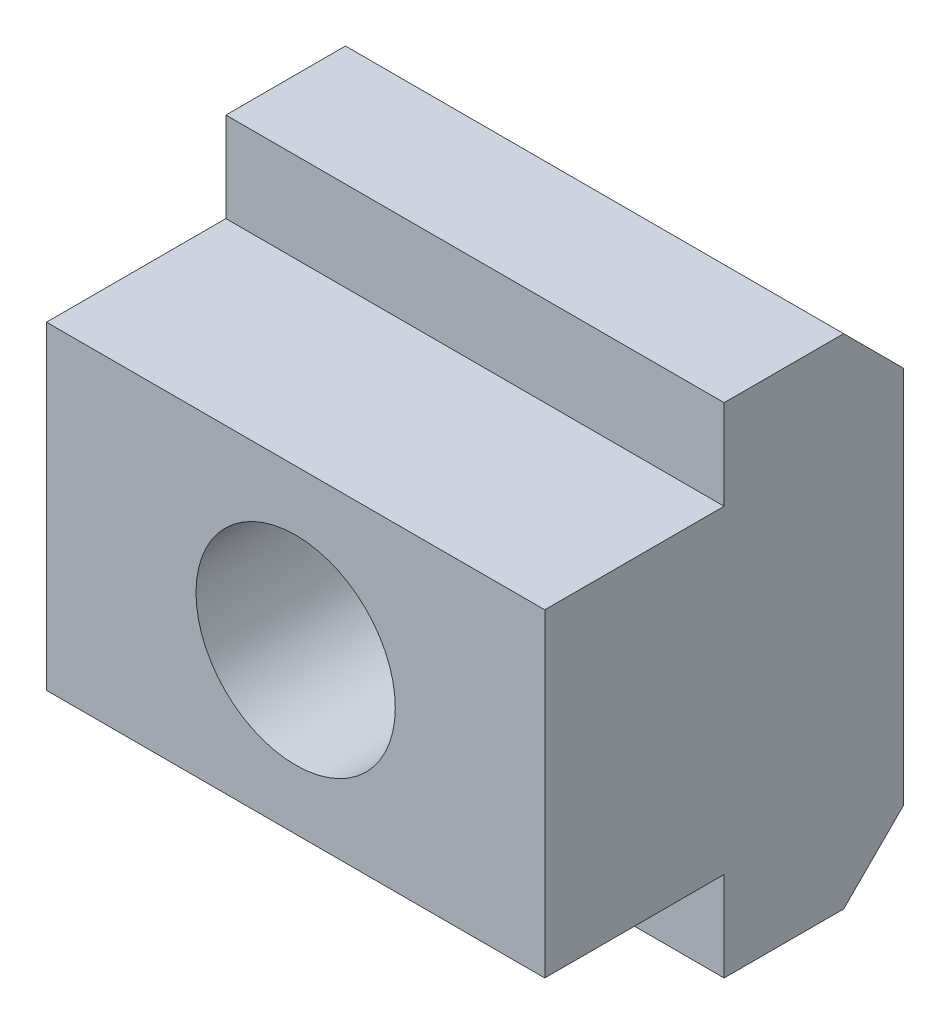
ISO-10303-21;
HEADER;
FILE_DESCRIPTION(('STEP AP214'),'2;1');
FILE_NAME('part.step','',(''),(''),'','','');
FILE_SCHEMA(('AUTOMOTIVE_DESIGN { 1 0 10303 214 1 1 1 1 }'));
ENDSEC;
DATA;
#1=APPLICATION_CONTEXT('core data for automotive mechanical design processes');
#2=APPLICATION_PROTOCOL_DEFINITION('international standard','automotive_design',2000,#1);
#3=PRODUCT_CONTEXT('',#1,'mechanical');
#4=PRODUCT('Part','Part','',(#3));
#5=PRODUCT_RELATED_PRODUCT_CATEGORY('part','',(#4));
#6=PRODUCT_DEFINITION_FORMATION('','',#4);
#7=PRODUCT_DEFINITION_CONTEXT('part definition',#1,'design');
#8=PRODUCT_DEFINITION('design','',#6,#7);
#9=PRODUCT_DEFINITION_SHAPE('','',#8);
#10=(LENGTH_UNIT() NAMED_UNIT(*) SI_UNIT(.MILLI.,.METRE.));
#11=(NAMED_UNIT(*) PLANE_ANGLE_UNIT() SI_UNIT($,.RADIAN.));
#12=(NAMED_UNIT(*) SI_UNIT($,.STERADIAN.) SOLID_ANGLE_UNIT());
#13=UNCERTAINTY_MEASURE_WITH_UNIT(LENGTH_MEASURE(1.E-05),#10,'distance_accuracy_value','');
#14=(GEOMETRIC_REPRESENTATION_CONTEXT(3) GLOBAL_UNCERTAINTY_ASSIGNED_CONTEXT((#13)) GLOBAL_UNIT_ASSIGNED_CONTEXT((#10,
#11,#12)) REPRESENTATION_CONTEXT('',''));
#15=CARTESIAN_POINT('',(0.,0.,0.));
#16=DIRECTION('',(0.,0.,1.));
#17=DIRECTION('',(1.,0.,0.));
#18=AXIS2_PLACEMENT_3D('',#15,#16,#17);
#19=CARTESIAN_POINT('',(-12.5,-8.,9.));
#20=DIRECTION('',(0.,1.,0.));
#21=DIRECTION('',(0.,0.,-1.));
#22=AXIS2_PLACEMENT_3D('',#19,#20,#21);
#23=PLANE('',#22);
#24=DIRECTION('',(0.,0.,1.));
#25=VECTOR('',#24,1.);
#26=CARTESIAN_POINT('',(12.5,-8.,9.));
#27=LINE('',#26,#25);
#28=CARTESIAN_POINT('',(12.5,-8.,0.));
#29=VERTEX_POINT('',#28);
#30=CARTESIAN_POINT('',(12.5,-8.,9.));
#31=VERTEX_POINT('',#30);
#32=EDGE_CURVE('E99',#29,#31,#27,.T.);
#33=ORIENTED_EDGE('',*,*,#32,.T.);
#34=DIRECTION('',(1.,0.,0.));
#35=VECTOR('',#34,1.);
#36=CARTESIAN_POINT('',(-12.5,-8.,9.));
#37=LINE('',#36,#35);
#38=CARTESIAN_POINT('',(-12.5,-8.,9.));
#39=VERTEX_POINT('',#38);
#40=EDGE_CURVE('E107',#39,#31,#37,.T.);
#41=ORIENTED_EDGE('',*,*,#40,.F.);
#42=DIRECTION('',(0.,0.,1.));
#43=VECTOR('',#42,1.);
#44=CARTESIAN_POINT('',(-12.5,-8.,9.));
#45=LINE('',#44,#43);
#46=CARTESIAN_POINT('',(-12.5,-8.,0.));
#47=VERTEX_POINT('',#46);
#48=EDGE_CURVE('E138',#47,#39,#45,.T.);
#49=ORIENTED_EDGE('',*,*,#48,.F.);
#50=DIRECTION('',(1.,0.,0.));
#51=VECTOR('',#50,1.);
#52=CARTESIAN_POINT('',(-12.5,-8.,0.));
#53=LINE('',#52,#51);
#54=EDGE_CURVE('E119',#47,#29,#53,.T.);
#55=ORIENTED_EDGE('',*,*,#54,.T.);
#56=EDGE_LOOP('',(#33,#41,#49,#55));
#57=FACE_BOUND('',#56,.T.);
#58=ADVANCED_FACE('F15',(#57),#23,.F.);
#59=CARTESIAN_POINT('',(-12.5,8.,9.));
#60=DIRECTION('',(0.,0.,-1.));
#61=DIRECTION('',(0.,-1.,0.));
#62=AXIS2_PLACEMENT_3D('',#59,#60,#61);
#63=PLANE('',#62);
#64=DIRECTION('',(0.,1.,0.));
#65=VECTOR('',#64,1.);
#66=CARTESIAN_POINT('',(12.5,8.,9.));
#67=LINE('',#66,#65);
#68=CARTESIAN_POINT('',(12.5,8.,9.));
#69=VERTEX_POINT('',#68);
#70=EDGE_CURVE('E93',#31,#69,#67,.T.);
#71=ORIENTED_EDGE('',*,*,#70,.T.);
#72=DIRECTION('',(1.,0.,0.));
#73=VECTOR('',#72,1.);
#74=CARTESIAN_POINT('',(-12.5,8.,9.));
#75=LINE('',#74,#73);
#76=CARTESIAN_POINT('',(-12.5,8.,9.));
#77=VERTEX_POINT('',#76);
#78=EDGE_CURVE('E115',#77,#69,#75,.T.);
#79=ORIENTED_EDGE('',*,*,#78,.F.);
#80=DIRECTION('',(0.,1.,0.));
#81=VECTOR('',#80,1.);
#82=CARTESIAN_POINT('',(-12.5,8.,9.));
#83=LINE('',#82,#81);
#84=EDGE_CURVE('E110',#39,#77,#83,.T.);
#85=ORIENTED_EDGE('',*,*,#84,.F.);
#86=ORIENTED_EDGE('',*,*,#40,.T.);
#87=EDGE_LOOP('',(#71,#79,#85,#86));
#88=FACE_BOUND('',#87,.T.);
#89=CARTESIAN_POINT('',(0.,0.,9.));
#90=DIRECTION('',(0.,0.,1.));
#91=DIRECTION('',(0.,1.,0.));
#92=AXIS2_PLACEMENT_3D('',#89,#90,#91);
#93=CIRCLE('',#92,5.);
#94=CARTESIAN_POINT('',(0.,5.00000000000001,9.));
#95=VERTEX_POINT('',#94);
#96=EDGE_CURVE('E123',#95,#95,#93,.T.);
#97=ORIENTED_EDGE('',*,*,#96,.F.);
#98=EDGE_LOOP('',(#97));
#99=FACE_BOUND('',#98,.T.);
#100=ADVANCED_FACE('F108',(#88,#99),#63,.F.);
#101=CARTESIAN_POINT('',(-12.5,8.,9.));
#102=DIRECTION('',(0.,-1.,0.));
#103=DIRECTION('',(1.,0.,0.));
#104=AXIS2_PLACEMENT_3D('',#101,#102,#103);
#105=PLANE('',#104);
#106=DIRECTION('',(0.,0.,-1.));
#107=VECTOR('',#106,1.);
#108=CARTESIAN_POINT('',(12.5,8.,9.));
#109=LINE('',#108,#107);
#110=CARTESIAN_POINT('',(12.5,8.,0.));
#111=VERTEX_POINT('',#110);
#112=EDGE_CURVE('E101',#69,#111,#109,.T.);
#113=ORIENTED_EDGE('',*,*,#112,.T.);
#114=DIRECTION('',(1.,0.,0.));
#115=VECTOR('',#114,1.);
#116=CARTESIAN_POINT('',(-12.5,8.,0.));
#117=LINE('',#116,#115);
#118=CARTESIAN_POINT('',(-12.5,8.,0.));
#119=VERTEX_POINT('',#118);
#120=EDGE_CURVE('E160',#119,#111,#117,.T.);
#121=ORIENTED_EDGE('',*,*,#120,.F.);
#122=DIRECTION('',(0.,0.,-1.));
#123=VECTOR('',#122,1.);
#124=CARTESIAN_POINT('',(-12.5,8.,9.));
#125=LINE('',#124,#123);
#126=EDGE_CURVE('E141',#77,#119,#125,.T.);
#127=ORIENTED_EDGE('',*,*,#126,.F.);
#128=ORIENTED_EDGE('',*,*,#78,.T.);
#129=EDGE_LOOP('',(#113,#121,#127,#128));
#130=FACE_BOUND('',#129,.T.);
#131=ADVANCED_FACE('F202',(#130),#105,.F.);
#132=CARTESIAN_POINT('',(-12.5,8.,0.));
#133=DIRECTION('',(0.,0.,-1.));
#134=DIRECTION('',(0.,-1.,0.));
#135=AXIS2_PLACEMENT_3D('',#132,#133,#134);
#136=PLANE('',#135);
#137=DIRECTION('',(0.,1.,0.));
#138=VECTOR('',#137,1.);
#139=CARTESIAN_POINT('',(12.5,8.,0.));
#140=LINE('',#139,#138);
#141=CARTESIAN_POINT('',(12.5,12.5,0.));
#142=VERTEX_POINT('',#141);
#143=EDGE_CURVE('E128',#111,#142,#140,.T.);
#144=ORIENTED_EDGE('',*,*,#143,.T.);
#145=DIRECTION('',(1.,0.,0.));
#146=VECTOR('',#145,1.);
#147=CARTESIAN_POINT('',(-12.5,12.5,0.));
#148=LINE('',#147,#146);
#149=CARTESIAN_POINT('',(-12.5,12.5,0.));
#150=VERTEX_POINT('',#149);
#151=EDGE_CURVE('E157',#150,#142,#148,.T.);
#152=ORIENTED_EDGE('',*,*,#151,.F.);
#153=DIRECTION('',(0.,1.,0.));
#154=VECTOR('',#153,1.);
#155=CARTESIAN_POINT('',(-12.5,8.,0.));
#156=LINE('',#155,#154);
#157=EDGE_CURVE('E143',#119,#150,#156,.T.);
#158=ORIENTED_EDGE('',*,*,#157,.F.);
#159=ORIENTED_EDGE('',*,*,#120,.T.);
#160=EDGE_LOOP('',(#144,#152,#158,#159));
#161=FACE_BOUND('',#160,.T.);
#162=ADVANCED_FACE('F198',(#161),#136,.F.);
#163=CARTESIAN_POINT('',(-12.5,12.5,0.));
#164=DIRECTION('',(0.,-1.,0.));
#165=DIRECTION('',(0.,0.,1.));
#166=AXIS2_PLACEMENT_3D('',#163,#164,#165);
#167=PLANE('',#166);
#168=DIRECTION('',(0.,0.,-1.));
#169=VECTOR('',#168,1.);
#170=CARTESIAN_POINT('',(12.5,12.5,0.));
#171=LINE('',#170,#169);
#172=CARTESIAN_POINT('',(12.5,12.5,-6.));
#173=VERTEX_POINT('',#172);
#174=EDGE_CURVE('E130',#142,#173,#171,.T.);
#175=ORIENTED_EDGE('',*,*,#174,.T.);
#176=DIRECTION('',(-1.,0.,0.));
#177=VECTOR('',#176,1.);
#178=CARTESIAN_POINT('',(-12.5,12.5,-6.));
#179=LINE('',#178,#177);
#180=CARTESIAN_POINT('',(-12.5,12.5,-6.));
#181=VERTEX_POINT('',#180);
#182=EDGE_CURVE('E9',#173,#181,#179,.T.);
#183=ORIENTED_EDGE('',*,*,#182,.T.);
#184=DIRECTION('',(0.,0.,-1.));
#185=VECTOR('',#184,1.);
#186=CARTESIAN_POINT('',(-12.5,12.5,0.));
#187=LINE('',#186,#185);
#188=EDGE_CURVE('E145',#150,#181,#187,.T.);
#189=ORIENTED_EDGE('',*,*,#188,.F.);
#190=ORIENTED_EDGE('',*,*,#151,.T.);
#191=EDGE_LOOP('',(#175,#183,#189,#190));
#192=FACE_BOUND('',#191,.T.);
#193=ADVANCED_FACE('F194',(#192),#167,.F.);
#194=CARTESIAN_POINT('',(-12.5,12.5,-9.));
#195=DIRECTION('',(0.,0.,1.));
#196=DIRECTION('',(0.,1.,0.));
#197=AXIS2_PLACEMENT_3D('',#194,#195,#196);
#198=PLANE('',#197);
#199=DIRECTION('',(0.,-1.,0.));
#200=VECTOR('',#199,1.);
#201=CARTESIAN_POINT('',(12.5,12.5,-9.));
#202=LINE('',#201,#200);
#203=CARTESIAN_POINT('',(12.5,9.5,-9.));
#204=VERTEX_POINT('',#203);
#205=CARTESIAN_POINT('',(12.5,-9.5,-9.));
#206=VERTEX_POINT('',#205);
#207=EDGE_CURVE('E132',#204,#206,#202,.T.);
#208=ORIENTED_EDGE('',*,*,#207,.T.);
#209=DIRECTION('',(-1.,0.,0.));
#210=VECTOR('',#209,1.);
#211=CARTESIAN_POINT('',(-12.5,-9.5,-9.));
#212=LINE('',#211,#210);
#213=CARTESIAN_POINT('',(-12.5,-9.5,-9.));
#214=VERTEX_POINT('',#213);
#215=EDGE_CURVE('E35',#206,#214,#212,.T.);
#216=ORIENTED_EDGE('',*,*,#215,.T.);
#217=DIRECTION('',(0.,-1.,0.));
#218=VECTOR('',#217,1.);
#219=CARTESIAN_POINT('',(-12.5,12.5,-9.));
#220=LINE('',#219,#218);
#221=CARTESIAN_POINT('',(-12.5,9.5,-9.));
#222=VERTEX_POINT('',#221);
#223=EDGE_CURVE('E147',#222,#214,#220,.T.);
#224=ORIENTED_EDGE('',*,*,#223,.F.);
#225=DIRECTION('',(1.,0.,0.));
#226=VECTOR('',#225,1.);
#227=CARTESIAN_POINT('',(-12.5,9.5,-9.));
#228=LINE('',#227,#226);
#229=EDGE_CURVE('E170',#222,#204,#228,.T.);
#230=ORIENTED_EDGE('',*,*,#229,.T.);
#231=EDGE_LOOP('',(#208,#216,#224,#230));
#232=FACE_BOUND('',#231,.T.);
#233=CARTESIAN_POINT('',(0.,0.,-9.));
#234=DIRECTION('',(0.,0.,1.));
#235=DIRECTION('',(0.,1.,0.));
#236=AXIS2_PLACEMENT_3D('',#233,#234,#235);
#237=CIRCLE('',#236,5.);
#238=CARTESIAN_POINT('',(0.,5.,-9.));
#239=VERTEX_POINT('',#238);
#240=EDGE_CURVE('E120',#239,#239,#237,.T.);
#241=ORIENTED_EDGE('',*,*,#240,.T.);
#242=EDGE_LOOP('',(#241));
#243=FACE_BOUND('',#242,.T.);
#244=ADVANCED_FACE('F187',(#232,#243),#198,.F.);
#245=CARTESIAN_POINT('',(-12.5,-12.5,0.));
#246=DIRECTION('',(0.,1.,0.));
#247=DIRECTION('',(0.,0.,-1.));
#248=AXIS2_PLACEMENT_3D('',#245,#246,#247);
#249=PLANE('',#248);
#250=DIRECTION('',(0.,0.,1.));
#251=VECTOR('',#250,1.);
#252=CARTESIAN_POINT('',(-12.5,-12.5,0.));
#253=LINE('',#252,#251);
#254=CARTESIAN_POINT('',(-12.5,-12.5,-6.));
#255=VERTEX_POINT('',#254);
#256=CARTESIAN_POINT('',(-12.5,-12.5,0.));
#257=VERTEX_POINT('',#256);
#258=EDGE_CURVE('E149',#255,#257,#253,.T.);
#259=ORIENTED_EDGE('',*,*,#258,.F.);
#260=DIRECTION('',(1.,0.,0.));
#261=VECTOR('',#260,1.);
#262=CARTESIAN_POINT('',(-12.5,-12.5,-6.));
#263=LINE('',#262,#261);
#264=CARTESIAN_POINT('',(12.5,-12.5,-6.));
#265=VERTEX_POINT('',#264);
#266=EDGE_CURVE('E114',#255,#265,#263,.T.);
#267=ORIENTED_EDGE('',*,*,#266,.T.);
#268=DIRECTION('',(0.,0.,1.));
#269=VECTOR('',#268,1.);
#270=CARTESIAN_POINT('',(12.5,-12.5,0.));
#271=LINE('',#270,#269);
#272=CARTESIAN_POINT('',(12.5,-12.5,0.));
#273=VERTEX_POINT('',#272);
#274=EDGE_CURVE('E134',#265,#273,#271,.T.);
#275=ORIENTED_EDGE('',*,*,#274,.T.);
#276=DIRECTION('',(1.,0.,0.));
#277=VECTOR('',#276,1.);
#278=CARTESIAN_POINT('',(-12.5,-12.5,0.));
#279=LINE('',#278,#277);
#280=EDGE_CURVE('E154',#257,#273,#279,.T.);
#281=ORIENTED_EDGE('',*,*,#280,.F.);
#282=EDGE_LOOP('',(#259,#267,#275,#281));
#283=FACE_BOUND('',#282,.T.);
#284=ADVANCED_FACE('F183',(#283),#249,.F.);
#285=CARTESIAN_POINT('',(-12.5,-8.,0.));
#286=DIRECTION('',(0.,0.,-1.));
#287=DIRECTION('',(0.,-1.,0.));
#288=AXIS2_PLACEMENT_3D('',#285,#286,#287);
#289=PLANE('',#288);
#290=DIRECTION('',(0.,1.,0.));
#291=VECTOR('',#290,1.);
#292=CARTESIAN_POINT('',(12.5,-8.,0.));
#293=LINE('',#292,#291);
#294=EDGE_CURVE('E136',#273,#29,#293,.T.);
#295=ORIENTED_EDGE('',*,*,#294,.T.);
#296=ORIENTED_EDGE('',*,*,#54,.F.);
#297=DIRECTION('',(0.,1.,0.));
#298=VECTOR('',#297,1.);
#299=CARTESIAN_POINT('',(-12.5,-8.,0.));
#300=LINE('',#299,#298);
#301=EDGE_CURVE('E151',#257,#47,#300,.T.);
#302=ORIENTED_EDGE('',*,*,#301,.F.);
#303=ORIENTED_EDGE('',*,*,#280,.T.);
#304=EDGE_LOOP('',(#295,#296,#302,#303));
#305=FACE_BOUND('',#304,.T.);
#306=ADVANCED_FACE('F204',(#305),#289,.F.);
#307=CARTESIAN_POINT('',(-12.5,-8.,9.));
#308=DIRECTION('',(-1.,0.,0.));
#309=DIRECTION('',(0.,-1.,0.));
#310=AXIS2_PLACEMENT_3D('',#307,#308,#309);
#311=PLANE('',#310);
#312=ORIENTED_EDGE('',*,*,#223,.T.);
#313=DIRECTION('',(0.,0.707106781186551,-0.707106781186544));
#314=VECTOR('',#313,1.);
#315=CARTESIAN_POINT('',(-12.5,-17.75,-0.75));
#316=LINE('',#315,#314);
#317=EDGE_CURVE('E22',#214,#255,#316,.F.);
#318=ORIENTED_EDGE('',*,*,#317,.T.);
#319=ORIENTED_EDGE('',*,*,#258,.T.);
#320=ORIENTED_EDGE('',*,*,#301,.T.);
#321=ORIENTED_EDGE('',*,*,#48,.T.);
#322=ORIENTED_EDGE('',*,*,#84,.T.);
#323=ORIENTED_EDGE('',*,*,#126,.T.);
#324=ORIENTED_EDGE('',*,*,#157,.T.);
#325=ORIENTED_EDGE('',*,*,#188,.T.);
#326=DIRECTION('',(0.,0.707106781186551,0.707106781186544));
#327=VECTOR('',#326,1.);
#328=CARTESIAN_POINT('',(-12.5,9.74999999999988,-8.75));
#329=LINE('',#328,#327);
#330=EDGE_CURVE('E174',#181,#222,#329,.F.);
#331=ORIENTED_EDGE('',*,*,#330,.T.);
#332=EDGE_LOOP('',(#312,#318,#319,#320,#321,#322,#323,#324,#325,#331));
#333=FACE_BOUND('',#332,.T.);
#334=ADVANCED_FACE('F178',(#333),#311,.T.);
#335=CARTESIAN_POINT('',(12.5,-8.,9.));
#336=DIRECTION('',(-1.,0.,0.));
#337=DIRECTION('',(0.,-1.,0.));
#338=AXIS2_PLACEMENT_3D('',#335,#336,#337);
#339=PLANE('',#338);
#340=ORIENTED_EDGE('',*,*,#274,.F.);
#341=DIRECTION('',(0.,-0.707106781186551,0.707106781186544));
#342=VECTOR('',#341,1.);
#343=CARTESIAN_POINT('',(12.5,-12.5,-6.));
#344=LINE('',#343,#342);
#345=EDGE_CURVE('E168',#265,#206,#344,.F.);
#346=ORIENTED_EDGE('',*,*,#345,.T.);
#347=ORIENTED_EDGE('',*,*,#207,.F.);
#348=DIRECTION('',(0.,-0.707106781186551,-0.707106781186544));
#349=VECTOR('',#348,1.);
#350=CARTESIAN_POINT('',(12.5,9.5,-9.));
#351=LINE('',#350,#349);
#352=EDGE_CURVE('E166',#204,#173,#351,.F.);
#353=ORIENTED_EDGE('',*,*,#352,.T.);
#354=ORIENTED_EDGE('',*,*,#174,.F.);
#355=ORIENTED_EDGE('',*,*,#143,.F.);
#356=ORIENTED_EDGE('',*,*,#112,.F.);
#357=ORIENTED_EDGE('',*,*,#70,.F.);
#358=ORIENTED_EDGE('',*,*,#32,.F.);
#359=ORIENTED_EDGE('',*,*,#294,.F.);
#360=EDGE_LOOP('',(#340,#346,#347,#353,#354,#355,#356,#357,#358,#359));
#361=FACE_BOUND('',#360,.T.);
#362=ADVANCED_FACE('F96',(#361),#339,.F.);
#363=CARTESIAN_POINT('',(-12.5,-12.5,-6.));
#364=DIRECTION('',(0.,0.707106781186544,0.707106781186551));
#365=DIRECTION('',(0.,0.707106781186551,-0.707106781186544));
#366=AXIS2_PLACEMENT_3D('',#363,#364,#365);
#367=PLANE('',#366);
#368=ORIENTED_EDGE('',*,*,#317,.F.);
#369=ORIENTED_EDGE('',*,*,#215,.F.);
#370=ORIENTED_EDGE('',*,*,#345,.F.);
#371=ORIENTED_EDGE('',*,*,#266,.F.);
#372=EDGE_LOOP('',(#368,#369,#370,#371));
#373=FACE_BOUND('',#372,.T.);
#374=ADVANCED_FACE('F185',(#373),#367,.F.);
#375=CARTESIAN_POINT('',(-12.5,9.5,-9.));
#376=DIRECTION('',(0.,-0.707106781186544,0.707106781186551));
#377=DIRECTION('',(0.,0.707106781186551,0.707106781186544));
#378=AXIS2_PLACEMENT_3D('',#375,#376,#377);
#379=PLANE('',#378);
#380=ORIENTED_EDGE('',*,*,#330,.F.);
#381=ORIENTED_EDGE('',*,*,#182,.F.);
#382=ORIENTED_EDGE('',*,*,#352,.F.);
#383=ORIENTED_EDGE('',*,*,#229,.F.);
#384=EDGE_LOOP('',(#380,#381,#382,#383));
#385=FACE_BOUND('',#384,.T.);
#386=ADVANCED_FACE('F192',(#385),#379,.F.);
#387=CARTESIAN_POINT('',(0.,0.,-9.));
#388=DIRECTION('',(0.,0.,1.));
#389=DIRECTION('',(0.,1.,0.));
#390=AXIS2_PLACEMENT_3D('',#387,#388,#389);
#391=CYLINDRICAL_SURFACE('',#390,5.);
#392=ORIENTED_EDGE('',*,*,#240,.F.);
#393=EDGE_LOOP('',(#392));
#394=FACE_BOUND('',#393,.T.);
#395=ORIENTED_EDGE('',*,*,#96,.T.);
#396=EDGE_LOOP('',(#395));
#397=FACE_BOUND('',#396,.T.);
#398=ADVANCED_FACE('F302',(#394,#397),#391,.F.);
#399=CLOSED_SHELL('',(#58,#100,#131,#162,#193,#244,#284,#306,#334,#362,#374,#386,#398));
#400=MANIFOLD_SOLID_BREP('B1',#399);
#401=ADVANCED_BREP_SHAPE_REPRESENTATION('',(#18,#400),#14);
#402=SHAPE_DEFINITION_REPRESENTATION(#9,#401);
ENDSEC;
END-ISO-10303-21;
